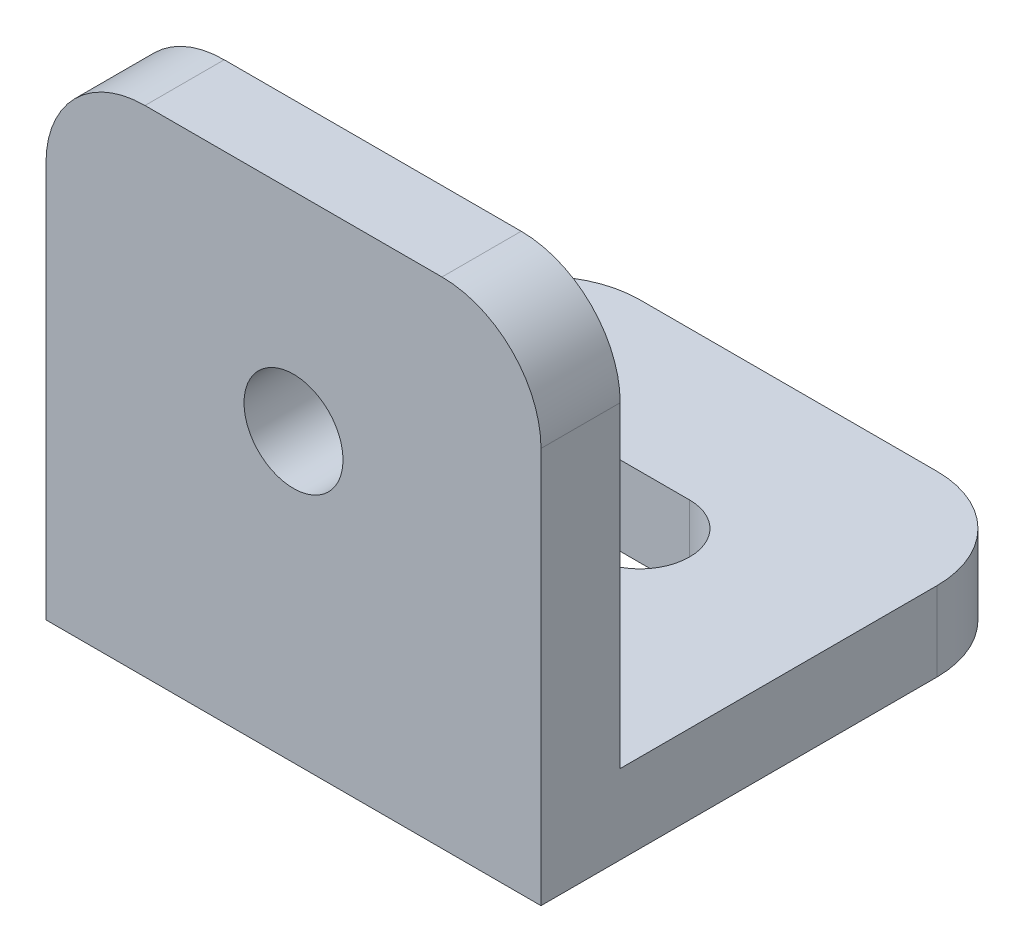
ISO-10303-21;
HEADER;
FILE_DESCRIPTION(('STEP AP214'),'2;1');
FILE_NAME('part.step','',(''),(''),'','','');
FILE_SCHEMA(('AUTOMOTIVE_DESIGN { 1 0 10303 214 1 1 1 1 }'));
ENDSEC;
DATA;
#1=APPLICATION_CONTEXT('core data for automotive mechanical design processes');
#2=APPLICATION_PROTOCOL_DEFINITION('international standard','automotive_design',2000,#1);
#3=PRODUCT_CONTEXT('',#1,'mechanical');
#4=PRODUCT('Part','Part','',(#3));
#5=PRODUCT_RELATED_PRODUCT_CATEGORY('part','',(#4));
#6=PRODUCT_DEFINITION_FORMATION('','',#4);
#7=PRODUCT_DEFINITION_CONTEXT('part definition',#1,'design');
#8=PRODUCT_DEFINITION('design','',#6,#7);
#9=PRODUCT_DEFINITION_SHAPE('','',#8);
#10=(LENGTH_UNIT() NAMED_UNIT(*) SI_UNIT(.MILLI.,.METRE.));
#11=(NAMED_UNIT(*) PLANE_ANGLE_UNIT() SI_UNIT($,.RADIAN.));
#12=(NAMED_UNIT(*) SI_UNIT($,.STERADIAN.) SOLID_ANGLE_UNIT());
#13=UNCERTAINTY_MEASURE_WITH_UNIT(LENGTH_MEASURE(1.E-05),#10,'distance_accuracy_value','');
#14=(GEOMETRIC_REPRESENTATION_CONTEXT(3) GLOBAL_UNCERTAINTY_ASSIGNED_CONTEXT((#13)) GLOBAL_UNIT_ASSIGNED_CONTEXT((#10,
#11,#12)) REPRESENTATION_CONTEXT('',''));
#15=CARTESIAN_POINT('',(0.,0.,0.));
#16=DIRECTION('',(0.,0.,1.));
#17=DIRECTION('',(1.,0.,0.));
#18=AXIS2_PLACEMENT_3D('',#15,#16,#17);
#19=CARTESIAN_POINT('',(25.,8.,0.));
#20=DIRECTION('',(0.,1.,0.));
#21=DIRECTION('',(0.,0.,1.));
#22=AXIS2_PLACEMENT_3D('',#19,#20,#21);
#23=PLANE('',#22);
#24=DIRECTION('',(-1.,0.,0.));
#25=VECTOR('',#24,1.);
#26=CARTESIAN_POINT('',(25.,8.,-50.));
#27=LINE('',#26,#25);
#28=CARTESIAN_POINT('',(15.,8.,-50.));
#29=VERTEX_POINT('',#28);
#30=CARTESIAN_POINT('',(-15.,8.,-50.));
#31=VERTEX_POINT('',#30);
#32=EDGE_CURVE('E281',#29,#31,#27,.T.);
#33=ORIENTED_EDGE('',*,*,#32,.T.);
#34=CARTESIAN_POINT('',(-15.,8.,-40.));
#35=DIRECTION('',(0.,1.,0.));
#36=DIRECTION('',(0.,0.,1.));
#37=AXIS2_PLACEMENT_3D('',#34,#35,#36);
#38=CIRCLE('',#37,10.);
#39=CARTESIAN_POINT('',(-25.,8.,-40.));
#40=VERTEX_POINT('',#39);
#41=EDGE_CURVE('E304',#31,#40,#38,.T.);
#42=ORIENTED_EDGE('',*,*,#41,.T.);
#43=DIRECTION('',(0.,0.,-1.));
#44=VECTOR('',#43,1.);
#45=CARTESIAN_POINT('',(-25.,8.,0.));
#46=LINE('',#45,#44);
#47=CARTESIAN_POINT('',(-25.,8.,-8.));
#48=VERTEX_POINT('',#47);
#49=EDGE_CURVE('E266',#48,#40,#46,.T.);
#50=ORIENTED_EDGE('',*,*,#49,.F.);
#51=DIRECTION('',(-1.,0.,0.));
#52=VECTOR('',#51,1.);
#53=CARTESIAN_POINT('',(25.,8.,-8.));
#54=LINE('',#53,#52);
#55=CARTESIAN_POINT('',(25.,8.,-8.));
#56=VERTEX_POINT('',#55);
#57=EDGE_CURVE('E278',#56,#48,#54,.T.);
#58=ORIENTED_EDGE('',*,*,#57,.F.);
#59=DIRECTION('',(0.,0.,-1.));
#60=VECTOR('',#59,1.);
#61=CARTESIAN_POINT('',(25.,8.,0.));
#62=LINE('',#61,#60);
#63=CARTESIAN_POINT('',(25.,8.,-40.));
#64=VERTEX_POINT('',#63);
#65=EDGE_CURVE('E255',#56,#64,#62,.T.);
#66=ORIENTED_EDGE('',*,*,#65,.T.);
#67=CARTESIAN_POINT('',(15.,8.,-40.));
#68=DIRECTION('',(0.,1.,0.));
#69=DIRECTION('',(0.,0.,1.));
#70=AXIS2_PLACEMENT_3D('',#67,#68,#69);
#71=CIRCLE('',#70,10.);
#72=EDGE_CURVE('E302',#64,#29,#71,.T.);
#73=ORIENTED_EDGE('',*,*,#72,.T.);
#74=EDGE_LOOP('',(#33,#42,#50,#58,#66,#73));
#75=FACE_BOUND('',#74,.T.);
#76=CARTESIAN_POINT('',(-5.,8.,-30.));
#77=DIRECTION('',(0.,1.,0.));
#78=DIRECTION('',(0.,0.,1.));
#79=AXIS2_PLACEMENT_3D('',#76,#77,#78);
#80=CIRCLE('',#79,5.);
#81=CARTESIAN_POINT('',(-5.,8.,-35.));
#82=VERTEX_POINT('',#81);
#83=CARTESIAN_POINT('',(-5.,8.,-25.));
#84=VERTEX_POINT('',#83);
#85=EDGE_CURVE('E217',#82,#84,#80,.T.);
#86=ORIENTED_EDGE('',*,*,#85,.F.);
#87=DIRECTION('',(1.,0.,0.));
#88=VECTOR('',#87,1.);
#89=CARTESIAN_POINT('',(-5.,8.,-35.));
#90=LINE('',#89,#88);
#91=CARTESIAN_POINT('',(5.,8.,-35.));
#92=VERTEX_POINT('',#91);
#93=EDGE_CURVE('E206',#82,#92,#90,.T.);
#94=ORIENTED_EDGE('',*,*,#93,.T.);
#95=CARTESIAN_POINT('',(5.,8.,-30.));
#96=DIRECTION('',(0.,1.,0.));
#97=DIRECTION('',(0.,0.,1.));
#98=AXIS2_PLACEMENT_3D('',#95,#96,#97);
#99=CIRCLE('',#98,5.);
#100=CARTESIAN_POINT('',(5.,8.,-25.));
#101=VERTEX_POINT('',#100);
#102=EDGE_CURVE('E228',#101,#92,#99,.T.);
#103=ORIENTED_EDGE('',*,*,#102,.F.);
#104=DIRECTION('',(1.,0.,0.));
#105=VECTOR('',#104,1.);
#106=CARTESIAN_POINT('',(-5.,8.,-25.));
#107=LINE('',#106,#105);
#108=EDGE_CURVE('E232',#84,#101,#107,.T.);
#109=ORIENTED_EDGE('',*,*,#108,.F.);
#110=EDGE_LOOP('',(#86,#94,#103,#109));
#111=FACE_BOUND('',#110,.T.);
#112=ADVANCED_FACE('F106',(#75,#111),#23,.T.);
#113=CARTESIAN_POINT('',(25.,0.,0.));
#114=DIRECTION('',(0.,1.,0.));
#115=DIRECTION('',(0.,0.,1.));
#116=AXIS2_PLACEMENT_3D('',#113,#114,#115);
#117=PLANE('',#116);
#118=CARTESIAN_POINT('',(5.,0.,-30.));
#119=DIRECTION('',(0.,1.,0.));
#120=DIRECTION('',(0.,0.,1.));
#121=AXIS2_PLACEMENT_3D('',#118,#119,#120);
#122=CIRCLE('',#121,5.);
#123=CARTESIAN_POINT('',(5.,0.,-25.));
#124=VERTEX_POINT('',#123);
#125=CARTESIAN_POINT('',(5.,0.,-35.));
#126=VERTEX_POINT('',#125);
#127=EDGE_CURVE('E239',#124,#126,#122,.T.);
#128=ORIENTED_EDGE('',*,*,#127,.T.);
#129=DIRECTION('',(1.,0.,0.));
#130=VECTOR('',#129,1.);
#131=CARTESIAN_POINT('',(-5.,0.,-35.));
#132=LINE('',#131,#130);
#133=CARTESIAN_POINT('',(-5.,0.,-35.));
#134=VERTEX_POINT('',#133);
#135=EDGE_CURVE('E218',#134,#126,#132,.T.);
#136=ORIENTED_EDGE('',*,*,#135,.F.);
#137=CARTESIAN_POINT('',(-5.,0.,-30.));
#138=DIRECTION('',(0.,1.,0.));
#139=DIRECTION('',(0.,0.,1.));
#140=AXIS2_PLACEMENT_3D('',#137,#138,#139);
#141=CIRCLE('',#140,5.);
#142=CARTESIAN_POINT('',(-5.,0.,-25.));
#143=VERTEX_POINT('',#142);
#144=EDGE_CURVE('E226',#134,#143,#141,.T.);
#145=ORIENTED_EDGE('',*,*,#144,.T.);
#146=DIRECTION('',(1.,0.,0.));
#147=VECTOR('',#146,1.);
#148=CARTESIAN_POINT('',(-5.,0.,-25.));
#149=LINE('',#148,#147);
#150=EDGE_CURVE('E507',#143,#124,#149,.T.);
#151=ORIENTED_EDGE('',*,*,#150,.T.);
#152=EDGE_LOOP('',(#128,#136,#145,#151));
#153=FACE_BOUND('',#152,.T.);
#154=DIRECTION('',(0.,0.,-1.));
#155=VECTOR('',#154,1.);
#156=CARTESIAN_POINT('',(-25.,0.,0.));
#157=LINE('',#156,#155);
#158=CARTESIAN_POINT('',(-25.,0.,0.));
#159=VERTEX_POINT('',#158);
#160=CARTESIAN_POINT('',(-25.,0.,-40.));
#161=VERTEX_POINT('',#160);
#162=EDGE_CURVE('E251',#159,#161,#157,.T.);
#163=ORIENTED_EDGE('',*,*,#162,.T.);
#164=CARTESIAN_POINT('',(-15.,0.,-40.));
#165=DIRECTION('',(0.,1.,0.));
#166=DIRECTION('',(0.,0.,1.));
#167=AXIS2_PLACEMENT_3D('',#164,#165,#166);
#168=CIRCLE('',#167,10.);
#169=CARTESIAN_POINT('',(-15.,0.,-50.));
#170=VERTEX_POINT('',#169);
#171=EDGE_CURVE('E295',#161,#170,#168,.F.);
#172=ORIENTED_EDGE('',*,*,#171,.T.);
#173=DIRECTION('',(-1.,0.,0.));
#174=VECTOR('',#173,1.);
#175=CARTESIAN_POINT('',(25.,0.,-50.));
#176=LINE('',#175,#174);
#177=CARTESIAN_POINT('',(15.,0.,-50.));
#178=VERTEX_POINT('',#177);
#179=EDGE_CURVE('E284',#178,#170,#176,.T.);
#180=ORIENTED_EDGE('',*,*,#179,.F.);
#181=CARTESIAN_POINT('',(15.,0.,-40.));
#182=DIRECTION('',(0.,1.,0.));
#183=DIRECTION('',(0.,0.,1.));
#184=AXIS2_PLACEMENT_3D('',#181,#182,#183);
#185=CIRCLE('',#184,10.);
#186=CARTESIAN_POINT('',(25.,0.,-40.));
#187=VERTEX_POINT('',#186);
#188=EDGE_CURVE('E293',#178,#187,#185,.F.);
#189=ORIENTED_EDGE('',*,*,#188,.T.);
#190=DIRECTION('',(0.,0.,-1.));
#191=VECTOR('',#190,1.);
#192=CARTESIAN_POINT('',(25.,0.,0.));
#193=LINE('',#192,#191);
#194=CARTESIAN_POINT('',(25.,0.,0.));
#195=VERTEX_POINT('',#194);
#196=EDGE_CURVE('E252',#195,#187,#193,.T.);
#197=ORIENTED_EDGE('',*,*,#196,.F.);
#198=DIRECTION('',(-1.,0.,0.));
#199=VECTOR('',#198,1.);
#200=CARTESIAN_POINT('',(25.,0.,0.));
#201=LINE('',#200,#199);
#202=EDGE_CURVE('E263',#195,#159,#201,.T.);
#203=ORIENTED_EDGE('',*,*,#202,.T.);
#204=EDGE_LOOP('',(#163,#172,#180,#189,#197,#203));
#205=FACE_BOUND('',#204,.T.);
#206=ADVANCED_FACE('F337',(#153,#205),#117,.F.);
#207=CARTESIAN_POINT('',(25.,8.,-50.));
#208=DIRECTION('',(0.,0.,-1.));
#209=DIRECTION('',(-1.,0.,0.));
#210=AXIS2_PLACEMENT_3D('',#207,#208,#209);
#211=PLANE('',#210);
#212=ORIENTED_EDGE('',*,*,#179,.T.);
#213=DIRECTION('',(0.,-1.,0.));
#214=VECTOR('',#213,1.);
#215=CARTESIAN_POINT('',(-15.,8.,-50.));
#216=LINE('',#215,#214);
#217=EDGE_CURVE('E300',#170,#31,#216,.F.);
#218=ORIENTED_EDGE('',*,*,#217,.T.);
#219=ORIENTED_EDGE('',*,*,#32,.F.);
#220=DIRECTION('',(0.,-1.,0.));
#221=VECTOR('',#220,1.);
#222=CARTESIAN_POINT('',(15.,0.,-50.));
#223=LINE('',#222,#221);
#224=EDGE_CURVE('E297',#29,#178,#223,.T.);
#225=ORIENTED_EDGE('',*,*,#224,.T.);
#226=EDGE_LOOP('',(#212,#218,#219,#225));
#227=FACE_BOUND('',#226,.T.);
#228=ADVANCED_FACE('F352',(#227),#211,.T.);
#229=CARTESIAN_POINT('',(25.,50.,-8.));
#230=DIRECTION('',(0.,0.,-1.));
#231=DIRECTION('',(0.,1.,0.));
#232=AXIS2_PLACEMENT_3D('',#229,#230,#231);
#233=PLANE('',#232);
#234=CARTESIAN_POINT('',(0.,29.,-8.));
#235=DIRECTION('',(0.,0.,-1.));
#236=DIRECTION('',(-1.,0.,0.));
#237=AXIS2_PLACEMENT_3D('',#234,#235,#236);
#238=CIRCLE('',#237,5.);
#239=CARTESIAN_POINT('',(-5.,29.,-8.));
#240=VERTEX_POINT('',#239);
#241=EDGE_CURVE('E245',#240,#240,#238,.T.);
#242=ORIENTED_EDGE('',*,*,#241,.F.);
#243=EDGE_LOOP('',(#242));
#244=FACE_BOUND('',#243,.T.);
#245=DIRECTION('',(0.,-1.,0.));
#246=VECTOR('',#245,1.);
#247=CARTESIAN_POINT('',(-25.,50.,-8.));
#248=LINE('',#247,#246);
#249=CARTESIAN_POINT('',(-25.,40.,-8.));
#250=VERTEX_POINT('',#249);
#251=EDGE_CURVE('E269',#250,#48,#248,.T.);
#252=ORIENTED_EDGE('',*,*,#251,.F.);
#253=CARTESIAN_POINT('',(-15.,40.,-8.));
#254=DIRECTION('',(0.,0.,-1.));
#255=DIRECTION('',(0.,1.,0.));
#256=AXIS2_PLACEMENT_3D('',#253,#254,#255);
#257=CIRCLE('',#256,10.);
#258=CARTESIAN_POINT('',(-15.,50.,-8.));
#259=VERTEX_POINT('',#258);
#260=EDGE_CURVE('E312',#250,#259,#257,.T.);
#261=ORIENTED_EDGE('',*,*,#260,.T.);
#262=DIRECTION('',(-1.,0.,0.));
#263=VECTOR('',#262,1.);
#264=CARTESIAN_POINT('',(25.,50.,-8.));
#265=LINE('',#264,#263);
#266=CARTESIAN_POINT('',(15.,50.,-8.));
#267=VERTEX_POINT('',#266);
#268=EDGE_CURVE('E276',#267,#259,#265,.T.);
#269=ORIENTED_EDGE('',*,*,#268,.F.);
#270=CARTESIAN_POINT('',(15.,40.,-8.));
#271=DIRECTION('',(0.,0.,-1.));
#272=DIRECTION('',(0.,1.,0.));
#273=AXIS2_PLACEMENT_3D('',#270,#271,#272);
#274=CIRCLE('',#273,10.);
#275=CARTESIAN_POINT('',(25.,40.,-8.));
#276=VERTEX_POINT('',#275);
#277=EDGE_CURVE('E310',#267,#276,#274,.T.);
#278=ORIENTED_EDGE('',*,*,#277,.T.);
#279=DIRECTION('',(0.,-1.,0.));
#280=VECTOR('',#279,1.);
#281=CARTESIAN_POINT('',(25.,50.,-8.));
#282=LINE('',#281,#280);
#283=EDGE_CURVE('E259',#276,#56,#282,.T.);
#284=ORIENTED_EDGE('',*,*,#283,.T.);
#285=ORIENTED_EDGE('',*,*,#57,.T.);
#286=EDGE_LOOP('',(#252,#261,#269,#278,#284,#285));
#287=FACE_BOUND('',#286,.T.);
#288=ADVANCED_FACE('F323',(#244,#287),#233,.T.);
#289=CARTESIAN_POINT('',(25.,50.,0.));
#290=DIRECTION('',(0.,1.,0.));
#291=DIRECTION('',(0.,0.,1.));
#292=AXIS2_PLACEMENT_3D('',#289,#290,#291);
#293=PLANE('',#292);
#294=ORIENTED_EDGE('',*,*,#268,.T.);
#295=DIRECTION('',(0.,0.,-1.));
#296=VECTOR('',#295,1.);
#297=CARTESIAN_POINT('',(-15.,50.,0.));
#298=LINE('',#297,#296);
#299=CARTESIAN_POINT('',(-15.,50.,0.));
#300=VERTEX_POINT('',#299);
#301=EDGE_CURVE('E121',#259,#300,#298,.F.);
#302=ORIENTED_EDGE('',*,*,#301,.T.);
#303=DIRECTION('',(-1.,0.,0.));
#304=VECTOR('',#303,1.);
#305=CARTESIAN_POINT('',(25.,50.,0.));
#306=LINE('',#305,#304);
#307=CARTESIAN_POINT('',(15.,50.,0.));
#308=VERTEX_POINT('',#307);
#309=EDGE_CURVE('E274',#308,#300,#306,.T.);
#310=ORIENTED_EDGE('',*,*,#309,.F.);
#311=DIRECTION('',(0.,0.,-1.));
#312=VECTOR('',#311,1.);
#313=CARTESIAN_POINT('',(15.,50.,-8.));
#314=LINE('',#313,#312);
#315=EDGE_CURVE('E314',#308,#267,#314,.T.);
#316=ORIENTED_EDGE('',*,*,#315,.T.);
#317=EDGE_LOOP('',(#294,#302,#310,#316));
#318=FACE_BOUND('',#317,.T.);
#319=ADVANCED_FACE('F319',(#318),#293,.T.);
#320=CARTESIAN_POINT('',(25.,50.,0.));
#321=DIRECTION('',(0.,0.,-1.));
#322=DIRECTION('',(0.,1.,0.));
#323=AXIS2_PLACEMENT_3D('',#320,#321,#322);
#324=PLANE('',#323);
#325=CARTESIAN_POINT('',(0.,29.,0.));
#326=DIRECTION('',(0.,0.,-1.));
#327=DIRECTION('',(-1.,0.,0.));
#328=AXIS2_PLACEMENT_3D('',#325,#326,#327);
#329=CIRCLE('',#328,5.);
#330=CARTESIAN_POINT('',(-5.,29.,0.));
#331=VERTEX_POINT('',#330);
#332=EDGE_CURVE('E248',#331,#331,#329,.T.);
#333=ORIENTED_EDGE('',*,*,#332,.T.);
#334=EDGE_LOOP('',(#333));
#335=FACE_BOUND('',#334,.T.);
#336=ORIENTED_EDGE('',*,*,#309,.T.);
#337=CARTESIAN_POINT('',(-15.,40.,0.));
#338=DIRECTION('',(0.,0.,-1.));
#339=DIRECTION('',(0.,1.,0.));
#340=AXIS2_PLACEMENT_3D('',#337,#338,#339);
#341=CIRCLE('',#340,10.);
#342=CARTESIAN_POINT('',(-25.,40.,0.));
#343=VERTEX_POINT('',#342);
#344=EDGE_CURVE('E13',#300,#343,#341,.F.);
#345=ORIENTED_EDGE('',*,*,#344,.T.);
#346=DIRECTION('',(0.,-1.,0.));
#347=VECTOR('',#346,1.);
#348=CARTESIAN_POINT('',(-25.,50.,0.));
#349=LINE('',#348,#347);
#350=EDGE_CURVE('E256',#343,#159,#349,.T.);
#351=ORIENTED_EDGE('',*,*,#350,.T.);
#352=ORIENTED_EDGE('',*,*,#202,.F.);
#353=DIRECTION('',(0.,-1.,0.));
#354=VECTOR('',#353,1.);
#355=CARTESIAN_POINT('',(25.,50.,0.));
#356=LINE('',#355,#354);
#357=CARTESIAN_POINT('',(25.,40.,0.));
#358=VERTEX_POINT('',#357);
#359=EDGE_CURVE('E261',#358,#195,#356,.T.);
#360=ORIENTED_EDGE('',*,*,#359,.F.);
#361=CARTESIAN_POINT('',(15.,40.,0.));
#362=DIRECTION('',(0.,0.,-1.));
#363=DIRECTION('',(0.,1.,0.));
#364=AXIS2_PLACEMENT_3D('',#361,#362,#363);
#365=CIRCLE('',#364,10.);
#366=EDGE_CURVE('E114',#358,#308,#365,.F.);
#367=ORIENTED_EDGE('',*,*,#366,.T.);
#368=EDGE_LOOP('',(#336,#345,#351,#352,#360,#367));
#369=FACE_BOUND('',#368,.T.);
#370=ADVANCED_FACE('F334',(#335,#369),#324,.F.);
#371=CARTESIAN_POINT('',(25.,0.,0.));
#372=DIRECTION('',(-1.,0.,0.));
#373=DIRECTION('',(0.,0.,1.));
#374=AXIS2_PLACEMENT_3D('',#371,#372,#373);
#375=PLANE('',#374);
#376=ORIENTED_EDGE('',*,*,#196,.T.);
#377=DIRECTION('',(0.,-1.,0.));
#378=VECTOR('',#377,1.);
#379=CARTESIAN_POINT('',(25.,8.,-40.));
#380=LINE('',#379,#378);
#381=EDGE_CURVE('E308',#187,#64,#380,.F.);
#382=ORIENTED_EDGE('',*,*,#381,.T.);
#383=ORIENTED_EDGE('',*,*,#65,.F.);
#384=ORIENTED_EDGE('',*,*,#283,.F.);
#385=DIRECTION('',(0.,0.,-1.));
#386=VECTOR('',#385,1.);
#387=CARTESIAN_POINT('',(25.,40.,0.));
#388=LINE('',#387,#386);
#389=EDGE_CURVE('E306',#276,#358,#388,.F.);
#390=ORIENTED_EDGE('',*,*,#389,.T.);
#391=ORIENTED_EDGE('',*,*,#359,.T.);
#392=EDGE_LOOP('',(#376,#382,#383,#384,#390,#391));
#393=FACE_BOUND('',#392,.T.);
#394=ADVANCED_FACE('F341',(#393),#375,.F.);
#395=CARTESIAN_POINT('',(-25.,0.,0.));
#396=DIRECTION('',(-1.,0.,0.));
#397=DIRECTION('',(0.,0.,1.));
#398=AXIS2_PLACEMENT_3D('',#395,#396,#397);
#399=PLANE('',#398);
#400=ORIENTED_EDGE('',*,*,#49,.T.);
#401=DIRECTION('',(0.,-1.,0.));
#402=VECTOR('',#401,1.);
#403=CARTESIAN_POINT('',(-25.,0.,-40.));
#404=LINE('',#403,#402);
#405=EDGE_CURVE('E290',#40,#161,#404,.T.);
#406=ORIENTED_EDGE('',*,*,#405,.T.);
#407=ORIENTED_EDGE('',*,*,#162,.F.);
#408=ORIENTED_EDGE('',*,*,#350,.F.);
#409=DIRECTION('',(0.,0.,-1.));
#410=VECTOR('',#409,1.);
#411=CARTESIAN_POINT('',(-25.,40.,0.));
#412=LINE('',#411,#410);
#413=EDGE_CURVE('E287',#343,#250,#412,.T.);
#414=ORIENTED_EDGE('',*,*,#413,.T.);
#415=ORIENTED_EDGE('',*,*,#251,.T.);
#416=EDGE_LOOP('',(#400,#406,#407,#408,#414,#415));
#417=FACE_BOUND('',#416,.T.);
#418=ADVANCED_FACE('F331',(#417),#399,.T.);
#419=CARTESIAN_POINT('',(0.,29.,-8.));
#420=DIRECTION('',(0.,0.,-1.));
#421=DIRECTION('',(-1.,0.,0.));
#422=AXIS2_PLACEMENT_3D('',#419,#420,#421);
#423=CYLINDRICAL_SURFACE('',#422,5.);
#424=ORIENTED_EDGE('',*,*,#332,.F.);
#425=EDGE_LOOP('',(#424));
#426=FACE_BOUND('',#425,.T.);
#427=ORIENTED_EDGE('',*,*,#241,.T.);
#428=EDGE_LOOP('',(#427));
#429=FACE_BOUND('',#428,.T.);
#430=ADVANCED_FACE('F431',(#426,#429),#423,.F.);
#431=CARTESIAN_POINT('',(5.,8.,-30.));
#432=DIRECTION('',(0.,1.,0.));
#433=DIRECTION('',(0.,0.,1.));
#434=AXIS2_PLACEMENT_3D('',#431,#432,#433);
#435=CYLINDRICAL_SURFACE('',#434,5.);
#436=ORIENTED_EDGE('',*,*,#127,.F.);
#437=DIRECTION('',(0.,1.,0.));
#438=VECTOR('',#437,1.);
#439=CARTESIAN_POINT('',(5.,8.,-25.));
#440=LINE('',#439,#438);
#441=EDGE_CURVE('E243',#101,#124,#440,.F.);
#442=ORIENTED_EDGE('',*,*,#441,.F.);
#443=ORIENTED_EDGE('',*,*,#102,.T.);
#444=DIRECTION('',(0.,1.,0.));
#445=VECTOR('',#444,1.);
#446=CARTESIAN_POINT('',(5.,8.,-35.));
#447=LINE('',#446,#445);
#448=EDGE_CURVE('E212',#126,#92,#447,.T.);
#449=ORIENTED_EDGE('',*,*,#448,.F.);
#450=EDGE_LOOP('',(#436,#442,#443,#449));
#451=FACE_BOUND('',#450,.T.);
#452=ADVANCED_FACE('F423',(#451),#435,.F.);
#453=CARTESIAN_POINT('',(-5.,8.,-30.));
#454=DIRECTION('',(0.,1.,0.));
#455=DIRECTION('',(0.,0.,1.));
#456=AXIS2_PLACEMENT_3D('',#453,#454,#455);
#457=CYLINDRICAL_SURFACE('',#456,5.);
#458=ORIENTED_EDGE('',*,*,#85,.T.);
#459=DIRECTION('',(0.,1.,0.));
#460=VECTOR('',#459,1.);
#461=CARTESIAN_POINT('',(-5.,8.,-25.));
#462=LINE('',#461,#460);
#463=EDGE_CURVE('E229',#143,#84,#462,.T.);
#464=ORIENTED_EDGE('',*,*,#463,.F.);
#465=ORIENTED_EDGE('',*,*,#144,.F.);
#466=DIRECTION('',(0.,1.,0.));
#467=VECTOR('',#466,1.);
#468=CARTESIAN_POINT('',(-5.,8.,-35.));
#469=LINE('',#468,#467);
#470=EDGE_CURVE('E209',#82,#134,#469,.F.);
#471=ORIENTED_EDGE('',*,*,#470,.F.);
#472=EDGE_LOOP('',(#458,#464,#465,#471));
#473=FACE_BOUND('',#472,.T.);
#474=ADVANCED_FACE('F222',(#473),#457,.F.);
#475=CARTESIAN_POINT('',(-5.,8.,-35.));
#476=DIRECTION('',(0.,0.,-1.));
#477=DIRECTION('',(-1.,0.,0.));
#478=AXIS2_PLACEMENT_3D('',#475,#476,#477);
#479=PLANE('',#478);
#480=ORIENTED_EDGE('',*,*,#448,.T.);
#481=ORIENTED_EDGE('',*,*,#93,.F.);
#482=ORIENTED_EDGE('',*,*,#470,.T.);
#483=ORIENTED_EDGE('',*,*,#135,.T.);
#484=EDGE_LOOP('',(#480,#481,#482,#483));
#485=FACE_BOUND('',#484,.T.);
#486=ADVANCED_FACE('F208',(#485),#479,.F.);
#487=CARTESIAN_POINT('',(-5.,8.,-25.));
#488=DIRECTION('',(0.,0.,1.));
#489=DIRECTION('',(1.,0.,0.));
#490=AXIS2_PLACEMENT_3D('',#487,#488,#489);
#491=PLANE('',#490);
#492=ORIENTED_EDGE('',*,*,#441,.T.);
#493=ORIENTED_EDGE('',*,*,#150,.F.);
#494=ORIENTED_EDGE('',*,*,#463,.T.);
#495=ORIENTED_EDGE('',*,*,#108,.T.);
#496=EDGE_LOOP('',(#492,#493,#494,#495));
#497=FACE_BOUND('',#496,.T.);
#498=ADVANCED_FACE('F377',(#497),#491,.F.);
#499=CARTESIAN_POINT('',(-15.,0.,-40.));
#500=DIRECTION('',(0.,-1.,0.));
#501=DIRECTION('',(0.,0.,-1.));
#502=AXIS2_PLACEMENT_3D('',#499,#500,#501);
#503=CYLINDRICAL_SURFACE('',#502,10.);
#504=ORIENTED_EDGE('',*,*,#41,.F.);
#505=ORIENTED_EDGE('',*,*,#217,.F.);
#506=ORIENTED_EDGE('',*,*,#171,.F.);
#507=ORIENTED_EDGE('',*,*,#405,.F.);
#508=EDGE_LOOP('',(#504,#505,#506,#507));
#509=FACE_BOUND('',#508,.T.);
#510=ADVANCED_FACE('F355',(#509),#503,.T.);
#511=CARTESIAN_POINT('',(15.,8.,-40.));
#512=DIRECTION('',(0.,1.,0.));
#513=DIRECTION('',(0.,0.,1.));
#514=AXIS2_PLACEMENT_3D('',#511,#512,#513);
#515=CYLINDRICAL_SURFACE('',#514,10.);
#516=ORIENTED_EDGE('',*,*,#72,.F.);
#517=ORIENTED_EDGE('',*,*,#381,.F.);
#518=ORIENTED_EDGE('',*,*,#188,.F.);
#519=ORIENTED_EDGE('',*,*,#224,.F.);
#520=EDGE_LOOP('',(#516,#517,#518,#519));
#521=FACE_BOUND('',#520,.T.);
#522=ADVANCED_FACE('F345',(#521),#515,.T.);
#523=CARTESIAN_POINT('',(-15.,40.,0.));
#524=DIRECTION('',(0.,0.,-1.));
#525=DIRECTION('',(-1.,0.,0.));
#526=AXIS2_PLACEMENT_3D('',#523,#524,#525);
#527=CYLINDRICAL_SURFACE('',#526,10.);
#528=ORIENTED_EDGE('',*,*,#344,.F.);
#529=ORIENTED_EDGE('',*,*,#301,.F.);
#530=ORIENTED_EDGE('',*,*,#260,.F.);
#531=ORIENTED_EDGE('',*,*,#413,.F.);
#532=EDGE_LOOP('',(#528,#529,#530,#531));
#533=FACE_BOUND('',#532,.T.);
#534=ADVANCED_FACE('F328',(#533),#527,.T.);
#535=CARTESIAN_POINT('',(15.,40.,0.));
#536=DIRECTION('',(0.,0.,1.));
#537=DIRECTION('',(1.,0.,0.));
#538=AXIS2_PLACEMENT_3D('',#535,#536,#537);
#539=CYLINDRICAL_SURFACE('',#538,10.);
#540=ORIENTED_EDGE('',*,*,#366,.F.);
#541=ORIENTED_EDGE('',*,*,#389,.F.);
#542=ORIENTED_EDGE('',*,*,#277,.F.);
#543=ORIENTED_EDGE('',*,*,#315,.F.);
#544=EDGE_LOOP('',(#540,#541,#542,#543));
#545=FACE_BOUND('',#544,.T.);
#546=ADVANCED_FACE('F108',(#545),#539,.T.);
#547=CLOSED_SHELL('',(#112,#206,#228,#288,#319,#370,#394,#418,#430,#452,#474,#486,#498,#510,
#522,#534,#546));
#548=MANIFOLD_SOLID_BREP('B2',#547);
#549=ADVANCED_BREP_SHAPE_REPRESENTATION('',(#18,#548),#14);
#550=SHAPE_DEFINITION_REPRESENTATION(#9,#549);
ENDSEC;
END-ISO-10303-21;
